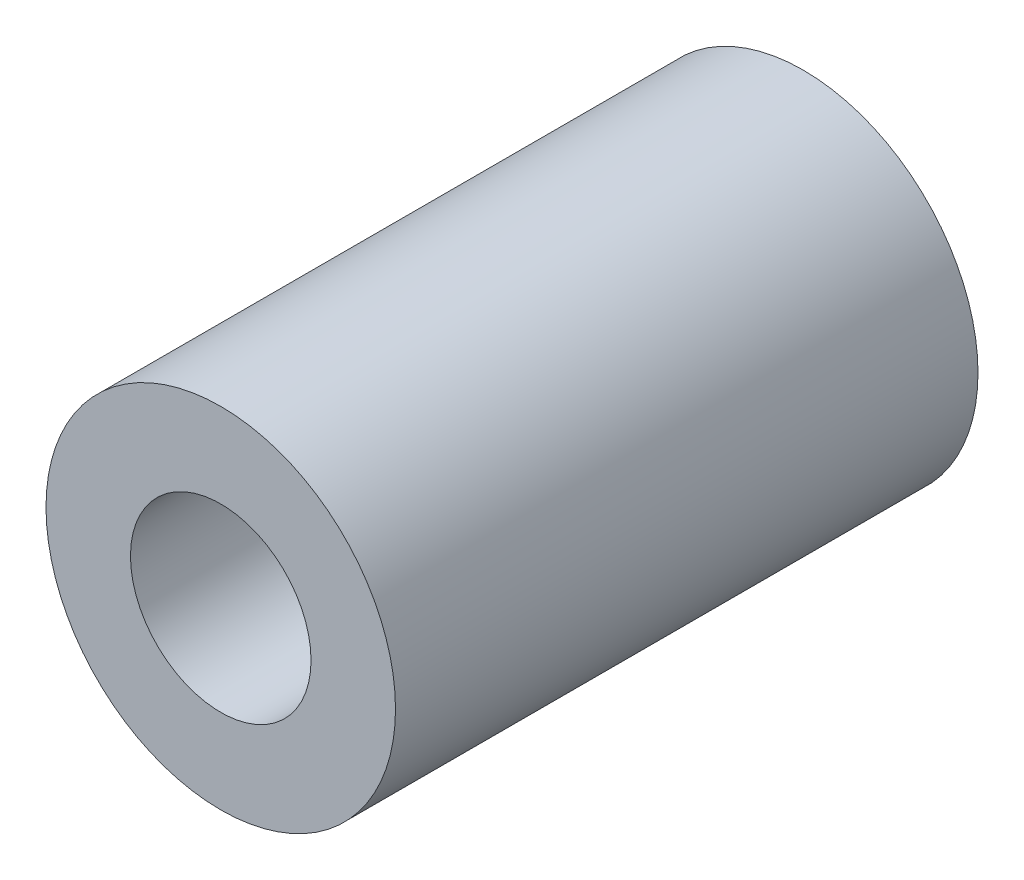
from build123d import *

# Parameters (mm, degrees)
ESQUISSE1_R      = 3
ESQUISSE1_R_2    = 1.55
EXTRUSION1_DEPTH = 10


with BuildPart() as part:
    # Esquisse1 → Extrusion1 (new body)
    with BuildSketch(Plane.XY):
        Circle(ESQUISSE1_R)
        Circle(ESQUISSE1_R_2, mode=Mode.SUBTRACT)
    extrude(amount=EXTRUSION1_DEPTH)


solid = part.part
